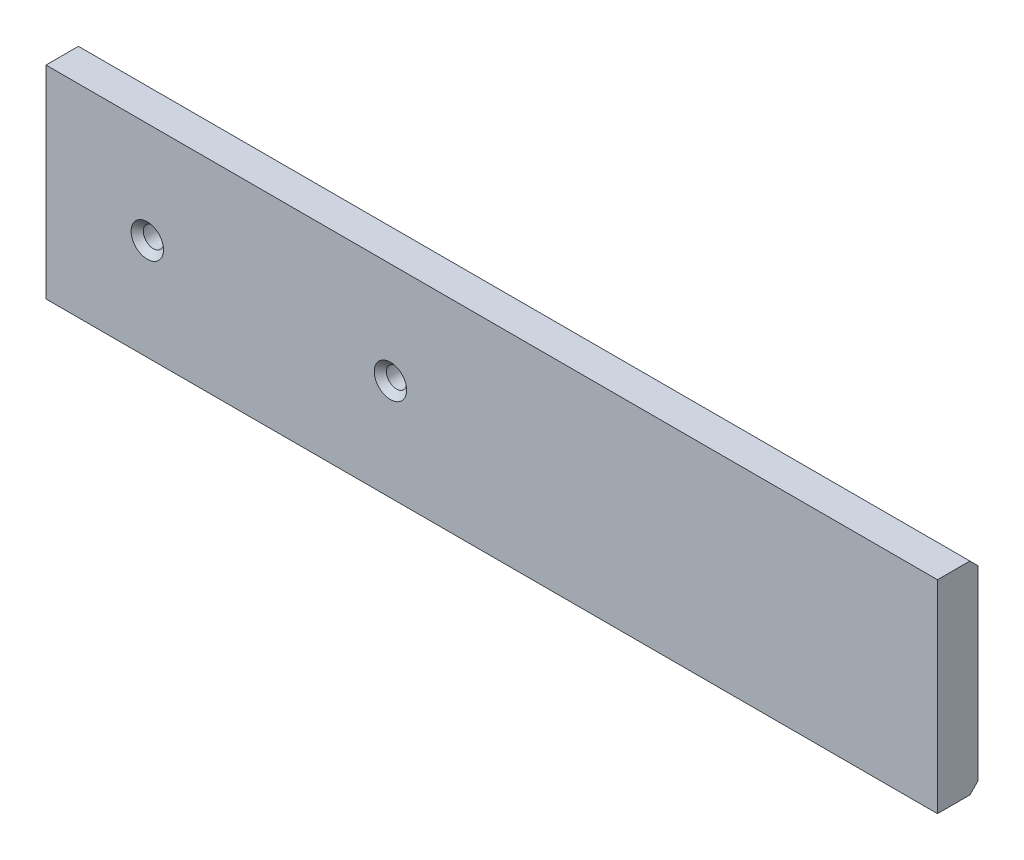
ISO-10303-21;
HEADER;
FILE_DESCRIPTION(('STEP AP214'),'2;1');
FILE_NAME('part.step','',(''),(''),'','','');
FILE_SCHEMA(('AUTOMOTIVE_DESIGN { 1 0 10303 214 1 1 1 1 }'));
ENDSEC;
DATA;
#1=APPLICATION_CONTEXT('core data for automotive mechanical design processes');
#2=APPLICATION_PROTOCOL_DEFINITION('international standard','automotive_design',2000,#1);
#3=PRODUCT_CONTEXT('',#1,'mechanical');
#4=PRODUCT('Part','Part','',(#3));
#5=PRODUCT_RELATED_PRODUCT_CATEGORY('part','',(#4));
#6=PRODUCT_DEFINITION_FORMATION('','',#4);
#7=PRODUCT_DEFINITION_CONTEXT('part definition',#1,'design');
#8=PRODUCT_DEFINITION('design','',#6,#7);
#9=PRODUCT_DEFINITION_SHAPE('','',#8);
#10=(LENGTH_UNIT() NAMED_UNIT(*) SI_UNIT(.MILLI.,.METRE.));
#11=(NAMED_UNIT(*) PLANE_ANGLE_UNIT() SI_UNIT($,.RADIAN.));
#12=(NAMED_UNIT(*) SI_UNIT($,.STERADIAN.) SOLID_ANGLE_UNIT());
#13=UNCERTAINTY_MEASURE_WITH_UNIT(LENGTH_MEASURE(1.E-05),#10,'distance_accuracy_value','');
#14=(GEOMETRIC_REPRESENTATION_CONTEXT(3) GLOBAL_UNCERTAINTY_ASSIGNED_CONTEXT((#13)) GLOBAL_UNIT_ASSIGNED_CONTEXT((#10,
#11,#12)) REPRESENTATION_CONTEXT('',''));
#15=CARTESIAN_POINT('',(0.,0.,0.));
#16=DIRECTION('',(0.,0.,1.));
#17=DIRECTION('',(1.,0.,0.));
#18=AXIS2_PLACEMENT_3D('',#15,#16,#17);
#19=CARTESIAN_POINT('',(0.,25.,10.));
#20=DIRECTION('',(1.,0.,0.));
#21=DIRECTION('',(0.,1.,0.));
#22=AXIS2_PLACEMENT_3D('',#19,#20,#21);
#23=PLANE('',#22);
#24=DIRECTION('',(0.,0.,-1.));
#25=VECTOR('',#24,1.);
#26=CARTESIAN_POINT('',(0.,25.,10.));
#27=LINE('',#26,#25);
#28=CARTESIAN_POINT('',(0.,25.,10.));
#29=VERTEX_POINT('',#28);
#30=CARTESIAN_POINT('',(0.,25.,2.));
#31=VERTEX_POINT('',#30);
#32=EDGE_CURVE('E198',#29,#31,#27,.T.);
#33=ORIENTED_EDGE('',*,*,#32,.T.);
#34=DIRECTION('',(0.,0.707106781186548,0.707106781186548));
#35=VECTOR('',#34,1.);
#36=CARTESIAN_POINT('',(0.,25.,2.));
#37=LINE('',#36,#35);
#38=CARTESIAN_POINT('',(0.,23.,0.));
#39=VERTEX_POINT('',#38);
#40=EDGE_CURVE('E122',#31,#39,#37,.F.);
#41=ORIENTED_EDGE('',*,*,#40,.T.);
#42=DIRECTION('',(0.,-1.,0.));
#43=VECTOR('',#42,1.);
#44=CARTESIAN_POINT('',(0.,25.,0.));
#45=LINE('',#44,#43);
#46=CARTESIAN_POINT('',(0.,-23.,0.));
#47=VERTEX_POINT('',#46);
#48=EDGE_CURVE('E195',#39,#47,#45,.T.);
#49=ORIENTED_EDGE('',*,*,#48,.T.);
#50=DIRECTION('',(0.,0.707106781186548,-0.707106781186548));
#51=VECTOR('',#50,1.);
#52=CARTESIAN_POINT('',(0.,-25.,2.));
#53=LINE('',#52,#51);
#54=CARTESIAN_POINT('',(0.,-25.,2.));
#55=VERTEX_POINT('',#54);
#56=EDGE_CURVE('E112',#47,#55,#53,.F.);
#57=ORIENTED_EDGE('',*,*,#56,.T.);
#58=DIRECTION('',(0.,0.,-1.));
#59=VECTOR('',#58,1.);
#60=CARTESIAN_POINT('',(0.,-25.,10.));
#61=LINE('',#60,#59);
#62=CARTESIAN_POINT('',(0.,-25.,10.));
#63=VERTEX_POINT('',#62);
#64=EDGE_CURVE('E93',#63,#55,#61,.T.);
#65=ORIENTED_EDGE('',*,*,#64,.F.);
#66=DIRECTION('',(0.,-1.,0.));
#67=VECTOR('',#66,1.);
#68=CARTESIAN_POINT('',(0.,25.,10.));
#69=LINE('',#68,#67);
#70=EDGE_CURVE('E99',#29,#63,#69,.T.);
#71=ORIENTED_EDGE('',*,*,#70,.F.);
#72=EDGE_LOOP('',(#33,#41,#49,#57,#65,#71));
#73=FACE_BOUND('',#72,.T.);
#74=ADVANCED_FACE('F33',(#73),#23,.F.);
#75=CARTESIAN_POINT('',(0.,-25.,10.));
#76=DIRECTION('',(0.,1.,0.));
#77=DIRECTION('',(0.,0.,1.));
#78=AXIS2_PLACEMENT_3D('',#75,#76,#77);
#79=PLANE('',#78);
#80=ORIENTED_EDGE('',*,*,#64,.T.);
#81=DIRECTION('',(1.,0.,0.));
#82=VECTOR('',#81,1.);
#83=CARTESIAN_POINT('',(0.,-25.,2.));
#84=LINE('',#83,#82);
#85=CARTESIAN_POINT('',(220.,-25.,2.));
#86=VERTEX_POINT('',#85);
#87=EDGE_CURVE('E130',#55,#86,#84,.T.);
#88=ORIENTED_EDGE('',*,*,#87,.T.);
#89=DIRECTION('',(0.,0.,-1.));
#90=VECTOR('',#89,1.);
#91=CARTESIAN_POINT('',(220.,-25.,10.));
#92=LINE('',#91,#90);
#93=CARTESIAN_POINT('',(220.,-25.,10.));
#94=VERTEX_POINT('',#93);
#95=EDGE_CURVE('E95',#94,#86,#92,.T.);
#96=ORIENTED_EDGE('',*,*,#95,.F.);
#97=DIRECTION('',(1.,0.,0.));
#98=VECTOR('',#97,1.);
#99=CARTESIAN_POINT('',(0.,-25.,10.));
#100=LINE('',#99,#98);
#101=EDGE_CURVE('E89',#63,#94,#100,.T.);
#102=ORIENTED_EDGE('',*,*,#101,.F.);
#103=EDGE_LOOP('',(#80,#88,#96,#102));
#104=FACE_BOUND('',#103,.T.);
#105=ADVANCED_FACE('F91',(#104),#79,.F.);
#106=CARTESIAN_POINT('',(220.,25.,10.));
#107=DIRECTION('',(-1.,0.,0.));
#108=DIRECTION('',(0.,0.,1.));
#109=AXIS2_PLACEMENT_3D('',#106,#107,#108);
#110=PLANE('',#109);
#111=DIRECTION('',(0.,1.,0.));
#112=VECTOR('',#111,1.);
#113=CARTESIAN_POINT('',(220.,25.,0.));
#114=LINE('',#113,#112);
#115=CARTESIAN_POINT('',(220.,-23.,0.));
#116=VERTEX_POINT('',#115);
#117=CARTESIAN_POINT('',(220.,23.,0.));
#118=VERTEX_POINT('',#117);
#119=EDGE_CURVE('E108',#116,#118,#114,.T.);
#120=ORIENTED_EDGE('',*,*,#119,.T.);
#121=DIRECTION('',(0.,-0.707106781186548,-0.707106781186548));
#122=VECTOR('',#121,1.);
#123=CARTESIAN_POINT('',(220.,25.,2.));
#124=LINE('',#123,#122);
#125=CARTESIAN_POINT('',(220.,25.,2.));
#126=VERTEX_POINT('',#125);
#127=EDGE_CURVE('E128',#118,#126,#124,.F.);
#128=ORIENTED_EDGE('',*,*,#127,.T.);
#129=DIRECTION('',(0.,0.,-1.));
#130=VECTOR('',#129,1.);
#131=CARTESIAN_POINT('',(220.,25.,10.));
#132=LINE('',#131,#130);
#133=CARTESIAN_POINT('',(220.,25.,10.));
#134=VERTEX_POINT('',#133);
#135=EDGE_CURVE('E117',#134,#126,#132,.T.);
#136=ORIENTED_EDGE('',*,*,#135,.F.);
#137=DIRECTION('',(0.,1.,0.));
#138=VECTOR('',#137,1.);
#139=CARTESIAN_POINT('',(220.,25.,10.));
#140=LINE('',#139,#138);
#141=EDGE_CURVE('E98',#94,#134,#140,.T.);
#142=ORIENTED_EDGE('',*,*,#141,.F.);
#143=ORIENTED_EDGE('',*,*,#95,.T.);
#144=DIRECTION('',(0.,-0.707106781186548,0.707106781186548));
#145=VECTOR('',#144,1.);
#146=CARTESIAN_POINT('',(220.,-25.,2.));
#147=LINE('',#146,#145);
#148=EDGE_CURVE('E48',#86,#116,#147,.F.);
#149=ORIENTED_EDGE('',*,*,#148,.T.);
#150=EDGE_LOOP('',(#120,#128,#136,#142,#143,#149));
#151=FACE_BOUND('',#150,.T.);
#152=ADVANCED_FACE('F157',(#151),#110,.F.);
#153=CARTESIAN_POINT('',(0.,25.,10.));
#154=DIRECTION('',(0.,-1.,0.));
#155=DIRECTION('',(0.,0.,-1.));
#156=AXIS2_PLACEMENT_3D('',#153,#154,#155);
#157=PLANE('',#156);
#158=ORIENTED_EDGE('',*,*,#135,.T.);
#159=DIRECTION('',(-1.,0.,0.));
#160=VECTOR('',#159,1.);
#161=CARTESIAN_POINT('',(0.,25.,2.));
#162=LINE('',#161,#160);
#163=EDGE_CURVE('E113',#126,#31,#162,.T.);
#164=ORIENTED_EDGE('',*,*,#163,.T.);
#165=ORIENTED_EDGE('',*,*,#32,.F.);
#166=DIRECTION('',(-1.,0.,0.));
#167=VECTOR('',#166,1.);
#168=CARTESIAN_POINT('',(0.,25.,10.));
#169=LINE('',#168,#167);
#170=EDGE_CURVE('E104',#134,#29,#169,.T.);
#171=ORIENTED_EDGE('',*,*,#170,.F.);
#172=EDGE_LOOP('',(#158,#164,#165,#171));
#173=FACE_BOUND('',#172,.T.);
#174=ADVANCED_FACE('F177',(#173),#157,.F.);
#175=CARTESIAN_POINT('',(0.,-25.,10.));
#176=DIRECTION('',(0.,0.,1.));
#177=DIRECTION('',(1.,0.,0.));
#178=AXIS2_PLACEMENT_3D('',#175,#176,#177);
#179=PLANE('',#178);
#180=CARTESIAN_POINT('',(85.,0.,10.));
#181=DIRECTION('',(0.,0.,1.));
#182=DIRECTION('',(1.,0.,0.));
#183=AXIS2_PLACEMENT_3D('',#180,#181,#182);
#184=CIRCLE('',#183,4.);
#185=CARTESIAN_POINT('',(89.,0.,10.));
#186=VERTEX_POINT('',#185);
#187=EDGE_CURVE('E41',#186,#186,#184,.F.);
#188=ORIENTED_EDGE('',*,*,#187,.T.);
#189=EDGE_LOOP('',(#188));
#190=FACE_BOUND('',#189,.T.);
#191=CARTESIAN_POINT('',(25.,0.,10.));
#192=DIRECTION('',(0.,0.,1.));
#193=DIRECTION('',(1.,0.,0.));
#194=AXIS2_PLACEMENT_3D('',#191,#192,#193);
#195=CIRCLE('',#194,3.99999999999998);
#196=CARTESIAN_POINT('',(29.,0.,10.));
#197=VERTEX_POINT('',#196);
#198=EDGE_CURVE('E132',#197,#197,#195,.F.);
#199=ORIENTED_EDGE('',*,*,#198,.T.);
#200=EDGE_LOOP('',(#199));
#201=FACE_BOUND('',#200,.T.);
#202=ORIENTED_EDGE('',*,*,#70,.T.);
#203=ORIENTED_EDGE('',*,*,#101,.T.);
#204=ORIENTED_EDGE('',*,*,#141,.T.);
#205=ORIENTED_EDGE('',*,*,#170,.T.);
#206=EDGE_LOOP('',(#202,#203,#204,#205));
#207=FACE_BOUND('',#206,.T.);
#208=ADVANCED_FACE('F102',(#190,#201,#207),#179,.T.);
#209=CARTESIAN_POINT('',(0.,-25.,0.));
#210=DIRECTION('',(0.,0.,1.));
#211=DIRECTION('',(1.,0.,0.));
#212=AXIS2_PLACEMENT_3D('',#209,#210,#211);
#213=PLANE('',#212);
#214=CARTESIAN_POINT('',(85.,0.,0.));
#215=DIRECTION('',(0.,0.,-1.));
#216=DIRECTION('',(-1.,0.,0.));
#217=AXIS2_PLACEMENT_3D('',#214,#215,#216);
#218=CIRCLE('',#217,2.5);
#219=CARTESIAN_POINT('',(82.5,0.,0.));
#220=VERTEX_POINT('',#219);
#221=EDGE_CURVE('E207',#220,#220,#218,.T.);
#222=ORIENTED_EDGE('',*,*,#221,.F.);
#223=EDGE_LOOP('',(#222));
#224=FACE_BOUND('',#223,.T.);
#225=CARTESIAN_POINT('',(25.,0.,0.));
#226=DIRECTION('',(0.,0.,-1.));
#227=DIRECTION('',(-1.,0.,0.));
#228=AXIS2_PLACEMENT_3D('',#225,#226,#227);
#229=CIRCLE('',#228,2.5);
#230=CARTESIAN_POINT('',(22.5,0.,0.));
#231=VERTEX_POINT('',#230);
#232=EDGE_CURVE('E202',#231,#231,#229,.T.);
#233=ORIENTED_EDGE('',*,*,#232,.F.);
#234=EDGE_LOOP('',(#233));
#235=FACE_BOUND('',#234,.T.);
#236=ORIENTED_EDGE('',*,*,#48,.F.);
#237=DIRECTION('',(1.,0.,0.));
#238=VECTOR('',#237,1.);
#239=CARTESIAN_POINT('',(0.,23.,0.));
#240=LINE('',#239,#238);
#241=EDGE_CURVE('E56',#39,#118,#240,.T.);
#242=ORIENTED_EDGE('',*,*,#241,.T.);
#243=ORIENTED_EDGE('',*,*,#119,.F.);
#244=DIRECTION('',(-1.,0.,0.));
#245=VECTOR('',#244,1.);
#246=CARTESIAN_POINT('',(0.,-23.,0.));
#247=LINE('',#246,#245);
#248=EDGE_CURVE('E124',#116,#47,#247,.T.);
#249=ORIENTED_EDGE('',*,*,#248,.T.);
#250=EDGE_LOOP('',(#236,#242,#243,#249));
#251=FACE_BOUND('',#250,.T.);
#252=ADVANCED_FACE('F176',(#224,#235,#251),#213,.F.);
#253=CARTESIAN_POINT('',(25.,0.,10.));
#254=DIRECTION('',(0.,0.,-1.));
#255=DIRECTION('',(-1.,0.,0.));
#256=AXIS2_PLACEMENT_3D('',#253,#254,#255);
#257=CYLINDRICAL_SURFACE('',#256,2.5);
#258=CARTESIAN_POINT('',(25.,0.,8.50000000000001));
#259=DIRECTION('',(0.,0.,1.));
#260=DIRECTION('',(1.,0.,0.));
#261=AXIS2_PLACEMENT_3D('',#258,#259,#260);
#262=CIRCLE('',#261,2.5);
#263=CARTESIAN_POINT('',(27.5,0.,8.50000000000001));
#264=VERTEX_POINT('',#263);
#265=EDGE_CURVE('E135',#264,#264,#262,.T.);
#266=ORIENTED_EDGE('',*,*,#265,.T.);
#267=EDGE_LOOP('',(#266));
#268=FACE_BOUND('',#267,.T.);
#269=ORIENTED_EDGE('',*,*,#232,.T.);
#270=EDGE_LOOP('',(#269));
#271=FACE_BOUND('',#270,.T.);
#272=ADVANCED_FACE('F165',(#268,#271),#257,.F.);
#273=CARTESIAN_POINT('',(0.,25.,2.));
#274=DIRECTION('',(0.,-0.707106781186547,0.707106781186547));
#275=DIRECTION('',(0.,-0.707106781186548,-0.707106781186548));
#276=AXIS2_PLACEMENT_3D('',#273,#274,#275);
#277=PLANE('',#276);
#278=ORIENTED_EDGE('',*,*,#127,.F.);
#279=ORIENTED_EDGE('',*,*,#241,.F.);
#280=ORIENTED_EDGE('',*,*,#40,.F.);
#281=ORIENTED_EDGE('',*,*,#163,.F.);
#282=EDGE_LOOP('',(#278,#279,#280,#281));
#283=FACE_BOUND('',#282,.T.);
#284=ADVANCED_FACE('F161',(#283),#277,.F.);
#285=CARTESIAN_POINT('',(0.,-25.,2.));
#286=DIRECTION('',(0.,0.707106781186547,0.707106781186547));
#287=DIRECTION('',(0.,-0.707106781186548,0.707106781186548));
#288=AXIS2_PLACEMENT_3D('',#285,#286,#287);
#289=PLANE('',#288);
#290=ORIENTED_EDGE('',*,*,#56,.F.);
#291=ORIENTED_EDGE('',*,*,#248,.F.);
#292=ORIENTED_EDGE('',*,*,#148,.F.);
#293=ORIENTED_EDGE('',*,*,#87,.F.);
#294=EDGE_LOOP('',(#290,#291,#292,#293));
#295=FACE_BOUND('',#294,.T.);
#296=ADVANCED_FACE('F164',(#295),#289,.F.);
#297=CARTESIAN_POINT('',(25.,0.,10.));
#298=DIRECTION('',(0.,0.,1.));
#299=DIRECTION('',(1.,0.,0.));
#300=AXIS2_PLACEMENT_3D('',#297,#298,#299);
#301=CONICAL_SURFACE('',#300,3.99999999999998,0.785398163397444);
#302=ORIENTED_EDGE('',*,*,#265,.F.);
#303=EDGE_LOOP('',(#302));
#304=FACE_BOUND('',#303,.T.);
#305=ORIENTED_EDGE('',*,*,#198,.F.);
#306=EDGE_LOOP('',(#305));
#307=FACE_BOUND('',#306,.T.);
#308=ADVANCED_FACE('F148',(#304,#307),#301,.F.);
#309=CARTESIAN_POINT('',(85.,0.,10.));
#310=DIRECTION('',(0.,0.,-1.));
#311=DIRECTION('',(-1.,0.,0.));
#312=AXIS2_PLACEMENT_3D('',#309,#310,#311);
#313=CYLINDRICAL_SURFACE('',#312,2.5);
#314=CARTESIAN_POINT('',(85.,0.,8.49999999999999));
#315=DIRECTION('',(0.,0.,1.));
#316=DIRECTION('',(1.,0.,0.));
#317=AXIS2_PLACEMENT_3D('',#314,#315,#316);
#318=CIRCLE('',#317,2.5);
#319=CARTESIAN_POINT('',(87.5,0.,8.49999999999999));
#320=VERTEX_POINT('',#319);
#321=EDGE_CURVE('E11',#320,#320,#318,.T.);
#322=ORIENTED_EDGE('',*,*,#321,.T.);
#323=EDGE_LOOP('',(#322));
#324=FACE_BOUND('',#323,.T.);
#325=ORIENTED_EDGE('',*,*,#221,.T.);
#326=EDGE_LOOP('',(#325));
#327=FACE_BOUND('',#326,.T.);
#328=ADVANCED_FACE('F143',(#324,#327),#313,.F.);
#329=CARTESIAN_POINT('',(85.,0.,10.));
#330=DIRECTION('',(0.,0.,1.));
#331=DIRECTION('',(1.,0.,0.));
#332=AXIS2_PLACEMENT_3D('',#329,#330,#331);
#333=CONICAL_SURFACE('',#332,4.,0.785398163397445);
#334=ORIENTED_EDGE('',*,*,#321,.F.);
#335=EDGE_LOOP('',(#334));
#336=FACE_BOUND('',#335,.T.);
#337=ORIENTED_EDGE('',*,*,#187,.F.);
#338=EDGE_LOOP('',(#337));
#339=FACE_BOUND('',#338,.T.);
#340=ADVANCED_FACE('F35',(#336,#339),#333,.F.);
#341=CLOSED_SHELL('',(#74,#105,#152,#174,#208,#252,#272,#284,#296,#308,#328,#340));
#342=MANIFOLD_SOLID_BREP('B2',#341);
#343=ADVANCED_BREP_SHAPE_REPRESENTATION('',(#18,#342),#14);
#344=SHAPE_DEFINITION_REPRESENTATION(#9,#343);
ENDSEC;
END-ISO-10303-21;
